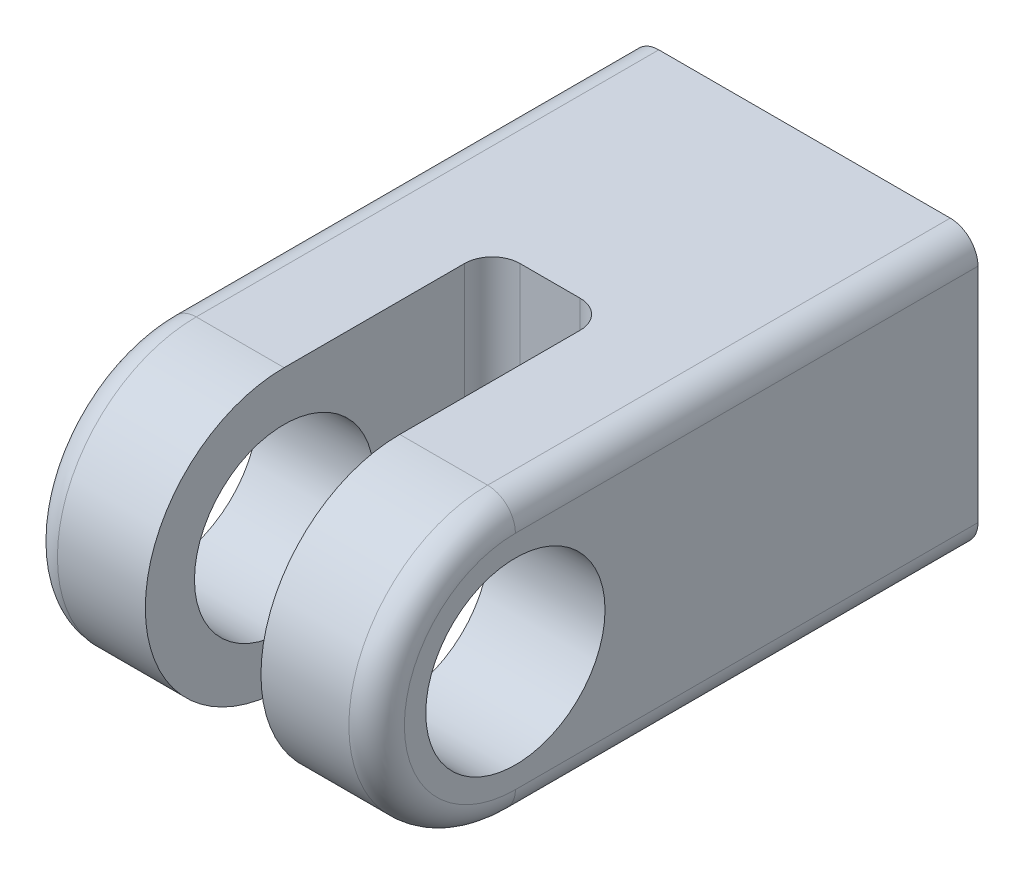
ISO-10303-21;
HEADER;
FILE_DESCRIPTION(('STEP AP214'),'2;1');
FILE_NAME('part.step','',(''),(''),'','','');
FILE_SCHEMA(('AUTOMOTIVE_DESIGN { 1 0 10303 214 1 1 1 1 }'));
ENDSEC;
DATA;
#1=APPLICATION_CONTEXT('core data for automotive mechanical design processes');
#2=APPLICATION_PROTOCOL_DEFINITION('international standard','automotive_design',2000,#1);
#3=PRODUCT_CONTEXT('',#1,'mechanical');
#4=PRODUCT('Part','Part','',(#3));
#5=PRODUCT_RELATED_PRODUCT_CATEGORY('part','',(#4));
#6=PRODUCT_DEFINITION_FORMATION('','',#4);
#7=PRODUCT_DEFINITION_CONTEXT('part definition',#1,'design');
#8=PRODUCT_DEFINITION('design','',#6,#7);
#9=PRODUCT_DEFINITION_SHAPE('','',#8);
#10=(LENGTH_UNIT() NAMED_UNIT(*) SI_UNIT(.MILLI.,.METRE.));
#11=(NAMED_UNIT(*) PLANE_ANGLE_UNIT() SI_UNIT($,.RADIAN.));
#12=(NAMED_UNIT(*) SI_UNIT($,.STERADIAN.) SOLID_ANGLE_UNIT());
#13=UNCERTAINTY_MEASURE_WITH_UNIT(LENGTH_MEASURE(1.E-05),#10,'distance_accuracy_value','');
#14=(GEOMETRIC_REPRESENTATION_CONTEXT(3) GLOBAL_UNCERTAINTY_ASSIGNED_CONTEXT((#13)) GLOBAL_UNIT_ASSIGNED_CONTEXT((#10,
#11,#12)) REPRESENTATION_CONTEXT('',''));
#15=CARTESIAN_POINT('',(0.,0.,0.));
#16=DIRECTION('',(0.,0.,1.));
#17=DIRECTION('',(1.,0.,0.));
#18=AXIS2_PLACEMENT_3D('',#15,#16,#17);
#19=CARTESIAN_POINT('',(9.525,0.,25.4));
#20=DIRECTION('',(-1.,0.,0.));
#21=DIRECTION('',(0.,0.,1.));
#22=AXIS2_PLACEMENT_3D('',#19,#20,#21);
#23=CYLINDRICAL_SURFACE('',#22,7.62);
#24=DIRECTION('',(-1.,0.,0.));
#25=VECTOR('',#24,1.);
#26=CARTESIAN_POINT('',(9.525,7.62,25.4));
#27=LINE('',#26,#25);
#28=CARTESIAN_POINT('',(-3.175,7.62,25.4));
#29=VERTEX_POINT('',#28);
#30=CARTESIAN_POINT('',(-8.00099999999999,7.62,25.4));
#31=VERTEX_POINT('',#30);
#32=EDGE_CURVE('E142',#29,#31,#27,.T.);
#33=ORIENTED_EDGE('',*,*,#32,.T.);
#34=CARTESIAN_POINT('',(-8.001,0.,25.4));
#35=DIRECTION('',(1.,0.,0.));
#36=DIRECTION('',(0.,0.,-1.));
#37=AXIS2_PLACEMENT_3D('',#34,#35,#36);
#38=CIRCLE('',#37,7.62);
#39=CARTESIAN_POINT('',(-8.00099999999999,-7.62,25.4));
#40=VERTEX_POINT('',#39);
#41=EDGE_CURVE('E214',#31,#40,#38,.T.);
#42=ORIENTED_EDGE('',*,*,#41,.T.);
#43=DIRECTION('',(-1.,0.,0.));
#44=VECTOR('',#43,1.);
#45=CARTESIAN_POINT('',(9.525,-7.62,25.4));
#46=LINE('',#45,#44);
#47=CARTESIAN_POINT('',(-3.175,-7.62,25.4));
#48=VERTEX_POINT('',#47);
#49=EDGE_CURVE('E177',#48,#40,#46,.T.);
#50=ORIENTED_EDGE('',*,*,#49,.F.);
#51=CARTESIAN_POINT('',(-3.175,0.,25.4));
#52=DIRECTION('',(-1.,0.,0.));
#53=DIRECTION('',(0.,0.,1.));
#54=AXIS2_PLACEMENT_3D('',#51,#52,#53);
#55=CIRCLE('',#54,7.62);
#56=EDGE_CURVE('E150',#48,#29,#55,.T.);
#57=ORIENTED_EDGE('',*,*,#56,.T.);
#58=EDGE_LOOP('',(#33,#42,#50,#57));
#59=FACE_BOUND('',#58,.T.);
#60=ADVANCED_FACE('F31',(#59),#23,.T.);
#61=CARTESIAN_POINT('',(9.525,7.62,0.));
#62=DIRECTION('',(0.,0.,1.));
#63=DIRECTION('',(0.,-1.,0.));
#64=AXIS2_PLACEMENT_3D('',#61,#62,#63);
#65=PLANE('',#64);
#66=CARTESIAN_POINT('',(0.,0.,0.));
#67=DIRECTION('',(0.,0.,-1.));
#68=DIRECTION('',(-1.,0.,0.));
#69=AXIS2_PLACEMENT_3D('',#66,#67,#68);
#70=CIRCLE('',#69,6.35);
#71=CARTESIAN_POINT('',(-6.35,0.,0.));
#72=VERTEX_POINT('',#71);
#73=EDGE_CURVE('E239',#72,#72,#70,.T.);
#74=ORIENTED_EDGE('',*,*,#73,.F.);
#75=EDGE_LOOP('',(#74));
#76=FACE_BOUND('',#75,.T.);
#77=DIRECTION('',(0.,1.,0.));
#78=VECTOR('',#77,1.);
#79=CARTESIAN_POINT('',(9.525,7.62,0.));
#80=LINE('',#79,#78);
#81=CARTESIAN_POINT('',(9.525,-6.096,0.));
#82=VERTEX_POINT('',#81);
#83=CARTESIAN_POINT('',(9.525,6.096,0.));
#84=VERTEX_POINT('',#83);
#85=EDGE_CURVE('E169',#82,#84,#80,.T.);
#86=ORIENTED_EDGE('',*,*,#85,.F.);
#87=CARTESIAN_POINT('',(8.001,-6.096,0.));
#88=DIRECTION('',(0.,0.,1.));
#89=DIRECTION('',(0.,-1.,0.));
#90=AXIS2_PLACEMENT_3D('',#87,#88,#89);
#91=CIRCLE('',#90,1.524);
#92=CARTESIAN_POINT('',(8.001,-7.62,0.));
#93=VERTEX_POINT('',#92);
#94=EDGE_CURVE('E200',#82,#93,#91,.F.);
#95=ORIENTED_EDGE('',*,*,#94,.T.);
#96=DIRECTION('',(-1.,0.,0.));
#97=VECTOR('',#96,1.);
#98=CARTESIAN_POINT('',(9.525,-7.62,0.));
#99=LINE('',#98,#97);
#100=CARTESIAN_POINT('',(-8.00099999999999,-7.62,0.));
#101=VERTEX_POINT('',#100);
#102=EDGE_CURVE('E172',#93,#101,#99,.T.);
#103=ORIENTED_EDGE('',*,*,#102,.T.);
#104=CARTESIAN_POINT('',(-8.001,-6.096,0.));
#105=DIRECTION('',(0.,0.,1.));
#106=DIRECTION('',(0.,-1.,0.));
#107=AXIS2_PLACEMENT_3D('',#104,#105,#106);
#108=CIRCLE('',#107,1.524);
#109=CARTESIAN_POINT('',(-9.525,-6.096,0.));
#110=VERTEX_POINT('',#109);
#111=EDGE_CURVE('E198',#101,#110,#108,.F.);
#112=ORIENTED_EDGE('',*,*,#111,.T.);
#113=DIRECTION('',(0.,1.,0.));
#114=VECTOR('',#113,1.);
#115=CARTESIAN_POINT('',(-9.525,7.62,0.));
#116=LINE('',#115,#114);
#117=CARTESIAN_POINT('',(-9.525,6.096,0.));
#118=VERTEX_POINT('',#117);
#119=EDGE_CURVE('E168',#110,#118,#116,.T.);
#120=ORIENTED_EDGE('',*,*,#119,.T.);
#121=CARTESIAN_POINT('',(-8.001,6.096,0.));
#122=DIRECTION('',(0.,0.,1.));
#123=DIRECTION('',(0.,-1.,0.));
#124=AXIS2_PLACEMENT_3D('',#121,#122,#123);
#125=CIRCLE('',#124,1.524);
#126=CARTESIAN_POINT('',(-8.00099999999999,7.62,0.));
#127=VERTEX_POINT('',#126);
#128=EDGE_CURVE('E194',#118,#127,#125,.F.);
#129=ORIENTED_EDGE('',*,*,#128,.T.);
#130=DIRECTION('',(-1.,0.,0.));
#131=VECTOR('',#130,1.);
#132=CARTESIAN_POINT('',(9.525,7.62,0.));
#133=LINE('',#132,#131);
#134=CARTESIAN_POINT('',(8.001,7.62,0.));
#135=VERTEX_POINT('',#134);
#136=EDGE_CURVE('E141',#135,#127,#133,.T.);
#137=ORIENTED_EDGE('',*,*,#136,.F.);
#138=CARTESIAN_POINT('',(8.001,6.096,0.));
#139=DIRECTION('',(0.,0.,1.));
#140=DIRECTION('',(0.,-1.,0.));
#141=AXIS2_PLACEMENT_3D('',#138,#139,#140);
#142=CIRCLE('',#141,1.524);
#143=EDGE_CURVE('E196',#135,#84,#142,.F.);
#144=ORIENTED_EDGE('',*,*,#143,.T.);
#145=EDGE_LOOP('',(#86,#95,#103,#112,#120,#129,#137,#144));
#146=FACE_BOUND('',#145,.T.);
#147=ADVANCED_FACE('F262',(#76,#146),#65,.F.);
#148=CARTESIAN_POINT('',(9.525,7.62,0.));
#149=DIRECTION('',(0.,-1.,0.));
#150=DIRECTION('',(0.,0.,-1.));
#151=AXIS2_PLACEMENT_3D('',#148,#149,#150);
#152=PLANE('',#151);
#153=CARTESIAN_POINT('',(8.001,7.62,25.4));
#154=VERTEX_POINT('',#153);
#155=CARTESIAN_POINT('',(3.17500000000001,7.62,25.4));
#156=VERTEX_POINT('',#155);
#157=EDGE_CURVE('E132',#154,#156,#27,.T.);
#158=ORIENTED_EDGE('',*,*,#157,.F.);
#159=DIRECTION('',(0.,0.,1.));
#160=VECTOR('',#159,1.);
#161=CARTESIAN_POINT('',(8.001,7.62,0.));
#162=LINE('',#161,#160);
#163=EDGE_CURVE('E218',#154,#135,#162,.F.);
#164=ORIENTED_EDGE('',*,*,#163,.T.);
#165=ORIENTED_EDGE('',*,*,#136,.T.);
#166=DIRECTION('',(0.,0.,1.));
#167=VECTOR('',#166,1.);
#168=CARTESIAN_POINT('',(-8.001,7.62,0.));
#169=LINE('',#168,#167);
#170=EDGE_CURVE('E216',#127,#31,#169,.T.);
#171=ORIENTED_EDGE('',*,*,#170,.T.);
#172=ORIENTED_EDGE('',*,*,#32,.F.);
#173=DIRECTION('',(0.,0.,1.));
#174=VECTOR('',#173,1.);
#175=CARTESIAN_POINT('',(-3.175,7.62,13.97));
#176=LINE('',#175,#174);
#177=CARTESIAN_POINT('',(-3.175,7.62,15.494));
#178=VERTEX_POINT('',#177);
#179=EDGE_CURVE('E155',#178,#29,#176,.T.);
#180=ORIENTED_EDGE('',*,*,#179,.F.);
#181=CARTESIAN_POINT('',(-1.651,7.62,15.494));
#182=DIRECTION('',(0.,-1.,0.));
#183=DIRECTION('',(0.,0.,-1.));
#184=AXIS2_PLACEMENT_3D('',#181,#182,#183);
#185=CIRCLE('',#184,1.524);
#186=CARTESIAN_POINT('',(-1.651,7.62,13.97));
#187=VERTEX_POINT('',#186);
#188=EDGE_CURVE('E53',#178,#187,#185,.T.);
#189=ORIENTED_EDGE('',*,*,#188,.T.);
#190=DIRECTION('',(-1.,0.,0.));
#191=VECTOR('',#190,1.);
#192=CARTESIAN_POINT('',(-3.175,7.62,13.97));
#193=LINE('',#192,#191);
#194=CARTESIAN_POINT('',(1.651,7.62,13.97));
#195=VERTEX_POINT('',#194);
#196=EDGE_CURVE('E154',#195,#187,#193,.T.);
#197=ORIENTED_EDGE('',*,*,#196,.F.);
#198=CARTESIAN_POINT('',(1.651,7.62,15.494));
#199=DIRECTION('',(0.,-1.,0.));
#200=DIRECTION('',(0.,0.,-1.));
#201=AXIS2_PLACEMENT_3D('',#198,#199,#200);
#202=CIRCLE('',#201,1.524);
#203=CARTESIAN_POINT('',(3.175,7.62,15.494));
#204=VERTEX_POINT('',#203);
#205=EDGE_CURVE('E40',#195,#204,#202,.T.);
#206=ORIENTED_EDGE('',*,*,#205,.T.);
#207=DIRECTION('',(0.,0.,-1.));
#208=VECTOR('',#207,1.);
#209=CARTESIAN_POINT('',(3.175,7.62,13.97));
#210=LINE('',#209,#208);
#211=EDGE_CURVE('E146',#156,#204,#210,.T.);
#212=ORIENTED_EDGE('',*,*,#211,.F.);
#213=EDGE_LOOP('',(#158,#164,#165,#171,#172,#180,#189,#197,#206,#212));
#214=FACE_BOUND('',#213,.T.);
#215=ADVANCED_FACE('F153',(#214),#152,.F.);
#216=CARTESIAN_POINT('',(8.001,-7.62,25.4));
#217=VERTEX_POINT('',#216);
#218=CARTESIAN_POINT('',(3.17500000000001,-7.62,25.4));
#219=VERTEX_POINT('',#218);
#220=EDGE_CURVE('E178',#217,#219,#46,.T.);
#221=ORIENTED_EDGE('',*,*,#220,.F.);
#222=CARTESIAN_POINT('',(8.001,0.,25.4));
#223=DIRECTION('',(1.,0.,0.));
#224=DIRECTION('',(0.,0.,-1.));
#225=AXIS2_PLACEMENT_3D('',#222,#223,#224);
#226=CIRCLE('',#225,7.62);
#227=EDGE_CURVE('E139',#217,#154,#226,.F.);
#228=ORIENTED_EDGE('',*,*,#227,.T.);
#229=ORIENTED_EDGE('',*,*,#157,.T.);
#230=CARTESIAN_POINT('',(3.17500000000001,0.,25.4));
#231=DIRECTION('',(1.,0.,0.));
#232=DIRECTION('',(0.,0.,-1.));
#233=AXIS2_PLACEMENT_3D('',#230,#231,#232);
#234=CIRCLE('',#233,7.62);
#235=EDGE_CURVE('E136',#156,#219,#234,.T.);
#236=ORIENTED_EDGE('',*,*,#235,.T.);
#237=EDGE_LOOP('',(#221,#228,#229,#236));
#238=FACE_BOUND('',#237,.T.);
#239=ADVANCED_FACE('F135',(#238),#23,.T.);
#240=CARTESIAN_POINT('',(9.525,-7.62,0.));
#241=DIRECTION('',(0.,1.,0.));
#242=DIRECTION('',(0.,0.,1.));
#243=AXIS2_PLACEMENT_3D('',#240,#241,#242);
#244=PLANE('',#243);
#245=ORIENTED_EDGE('',*,*,#102,.F.);
#246=DIRECTION('',(0.,0.,-1.));
#247=VECTOR('',#246,1.);
#248=CARTESIAN_POINT('',(8.001,-7.62,25.4));
#249=LINE('',#248,#247);
#250=EDGE_CURVE('E205',#93,#217,#249,.F.);
#251=ORIENTED_EDGE('',*,*,#250,.T.);
#252=ORIENTED_EDGE('',*,*,#220,.T.);
#253=DIRECTION('',(0.,0.,-1.));
#254=VECTOR('',#253,1.);
#255=CARTESIAN_POINT('',(3.175,-7.62,0.));
#256=LINE('',#255,#254);
#257=CARTESIAN_POINT('',(3.175,-7.62,15.494));
#258=VERTEX_POINT('',#257);
#259=EDGE_CURVE('E149',#219,#258,#256,.T.);
#260=ORIENTED_EDGE('',*,*,#259,.T.);
#261=CARTESIAN_POINT('',(1.651,-7.62,15.494));
#262=DIRECTION('',(0.,1.,0.));
#263=DIRECTION('',(0.,0.,1.));
#264=AXIS2_PLACEMENT_3D('',#261,#262,#263);
#265=CIRCLE('',#264,1.524);
#266=CARTESIAN_POINT('',(1.651,-7.62,13.97));
#267=VERTEX_POINT('',#266);
#268=EDGE_CURVE('E11',#258,#267,#265,.T.);
#269=ORIENTED_EDGE('',*,*,#268,.T.);
#270=DIRECTION('',(-1.,0.,0.));
#271=VECTOR('',#270,1.);
#272=CARTESIAN_POINT('',(-3.175,-7.62,13.97));
#273=LINE('',#272,#271);
#274=CARTESIAN_POINT('',(-1.651,-7.62,13.97));
#275=VERTEX_POINT('',#274);
#276=EDGE_CURVE('E151',#267,#275,#273,.T.);
#277=ORIENTED_EDGE('',*,*,#276,.T.);
#278=CARTESIAN_POINT('',(-1.651,-7.62,15.494));
#279=DIRECTION('',(0.,1.,0.));
#280=DIRECTION('',(0.,0.,1.));
#281=AXIS2_PLACEMENT_3D('',#278,#279,#280);
#282=CIRCLE('',#281,1.524);
#283=CARTESIAN_POINT('',(-3.175,-7.62,15.494));
#284=VERTEX_POINT('',#283);
#285=EDGE_CURVE('E231',#275,#284,#282,.T.);
#286=ORIENTED_EDGE('',*,*,#285,.T.);
#287=DIRECTION('',(0.,0.,1.));
#288=VECTOR('',#287,1.);
#289=CARTESIAN_POINT('',(-3.175,-7.62,13.97));
#290=LINE('',#289,#288);
#291=EDGE_CURVE('E157',#284,#48,#290,.T.);
#292=ORIENTED_EDGE('',*,*,#291,.T.);
#293=ORIENTED_EDGE('',*,*,#49,.T.);
#294=DIRECTION('',(0.,0.,-1.));
#295=VECTOR('',#294,1.);
#296=CARTESIAN_POINT('',(-8.001,-7.62,0.));
#297=LINE('',#296,#295);
#298=EDGE_CURVE('E202',#40,#101,#297,.T.);
#299=ORIENTED_EDGE('',*,*,#298,.T.);
#300=EDGE_LOOP('',(#245,#251,#252,#260,#269,#277,#286,#292,#293,#299));
#301=FACE_BOUND('',#300,.T.);
#302=ADVANCED_FACE('F268',(#301),#244,.F.);
#303=CARTESIAN_POINT('',(9.525,0.,25.4));
#304=DIRECTION('',(1.,0.,0.));
#305=DIRECTION('',(0.,0.,-1.));
#306=AXIS2_PLACEMENT_3D('',#303,#304,#305);
#307=PLANE('',#306);
#308=CARTESIAN_POINT('',(9.525,0.,25.4));
#309=DIRECTION('',(1.,0.,0.));
#310=DIRECTION('',(0.,0.,-1.));
#311=AXIS2_PLACEMENT_3D('',#308,#309,#310);
#312=CIRCLE('',#311,4.92125);
#313=CARTESIAN_POINT('',(9.525,0.,20.47875));
#314=VERTEX_POINT('',#313);
#315=EDGE_CURVE('E422',#314,#314,#312,.T.);
#316=ORIENTED_EDGE('',*,*,#315,.F.);
#317=EDGE_LOOP('',(#316));
#318=FACE_BOUND('',#317,.T.);
#319=CARTESIAN_POINT('',(9.525,0.,25.4));
#320=DIRECTION('',(1.,0.,0.));
#321=DIRECTION('',(0.,0.,-1.));
#322=AXIS2_PLACEMENT_3D('',#319,#320,#321);
#323=CIRCLE('',#322,6.096);
#324=CARTESIAN_POINT('',(9.525,6.096,25.4));
#325=VERTEX_POINT('',#324);
#326=CARTESIAN_POINT('',(9.525,-6.096,25.4));
#327=VERTEX_POINT('',#326);
#328=EDGE_CURVE('E189',#325,#327,#323,.T.);
#329=ORIENTED_EDGE('',*,*,#328,.T.);
#330=DIRECTION('',(0.,0.,-1.));
#331=VECTOR('',#330,1.);
#332=CARTESIAN_POINT('',(9.525,-6.096,0.));
#333=LINE('',#332,#331);
#334=EDGE_CURVE('E191',#327,#82,#333,.T.);
#335=ORIENTED_EDGE('',*,*,#334,.T.);
#336=ORIENTED_EDGE('',*,*,#85,.T.);
#337=DIRECTION('',(0.,0.,1.));
#338=VECTOR('',#337,1.);
#339=CARTESIAN_POINT('',(9.525,6.096,25.4));
#340=LINE('',#339,#338);
#341=EDGE_CURVE('E183',#84,#325,#340,.T.);
#342=ORIENTED_EDGE('',*,*,#341,.T.);
#343=EDGE_LOOP('',(#329,#335,#336,#342));
#344=FACE_BOUND('',#343,.T.);
#345=ADVANCED_FACE('F283',(#318,#344),#307,.T.);
#346=CARTESIAN_POINT('',(-9.525,0.,25.4));
#347=DIRECTION('',(1.,0.,0.));
#348=DIRECTION('',(0.,0.,-1.));
#349=AXIS2_PLACEMENT_3D('',#346,#347,#348);
#350=PLANE('',#349);
#351=CARTESIAN_POINT('',(-9.525,0.,25.4));
#352=DIRECTION('',(1.,0.,0.));
#353=DIRECTION('',(0.,0.,-1.));
#354=AXIS2_PLACEMENT_3D('',#351,#352,#353);
#355=CIRCLE('',#354,4.92125);
#356=CARTESIAN_POINT('',(-9.525,0.,20.47875));
#357=VERTEX_POINT('',#356);
#358=EDGE_CURVE('E187',#357,#357,#355,.T.);
#359=ORIENTED_EDGE('',*,*,#358,.T.);
#360=EDGE_LOOP('',(#359));
#361=FACE_BOUND('',#360,.T.);
#362=ORIENTED_EDGE('',*,*,#119,.F.);
#363=DIRECTION('',(0.,0.,-1.));
#364=VECTOR('',#363,1.);
#365=CARTESIAN_POINT('',(-9.525,-6.096,25.4));
#366=LINE('',#365,#364);
#367=CARTESIAN_POINT('',(-9.525,-6.096,25.4));
#368=VERTEX_POINT('',#367);
#369=EDGE_CURVE('E212',#110,#368,#366,.F.);
#370=ORIENTED_EDGE('',*,*,#369,.T.);
#371=CARTESIAN_POINT('',(-9.525,0.,25.4));
#372=DIRECTION('',(1.,0.,0.));
#373=DIRECTION('',(0.,0.,-1.));
#374=AXIS2_PLACEMENT_3D('',#371,#372,#373);
#375=CIRCLE('',#374,6.096);
#376=CARTESIAN_POINT('',(-9.525,6.096,25.4));
#377=VERTEX_POINT('',#376);
#378=EDGE_CURVE('E210',#368,#377,#375,.F.);
#379=ORIENTED_EDGE('',*,*,#378,.T.);
#380=DIRECTION('',(0.,0.,1.));
#381=VECTOR('',#380,1.);
#382=CARTESIAN_POINT('',(-9.525,6.096,25.4));
#383=LINE('',#382,#381);
#384=EDGE_CURVE('E208',#377,#118,#383,.F.);
#385=ORIENTED_EDGE('',*,*,#384,.T.);
#386=EDGE_LOOP('',(#362,#370,#379,#385));
#387=FACE_BOUND('',#386,.T.);
#388=ADVANCED_FACE('F259',(#361,#387),#350,.F.);
#389=CARTESIAN_POINT('',(-3.175,-7.62,13.97));
#390=DIRECTION('',(-1.,0.,0.));
#391=DIRECTION('',(0.,0.,1.));
#392=AXIS2_PLACEMENT_3D('',#389,#390,#391);
#393=PLANE('',#392);
#394=CARTESIAN_POINT('',(-3.175,0.,25.4));
#395=DIRECTION('',(-1.,0.,0.));
#396=DIRECTION('',(0.,0.,1.));
#397=AXIS2_PLACEMENT_3D('',#394,#395,#396);
#398=CIRCLE('',#397,4.92125);
#399=CARTESIAN_POINT('',(-3.175,0.,20.47875));
#400=VERTEX_POINT('',#399);
#401=EDGE_CURVE('E159',#400,#400,#398,.T.);
#402=ORIENTED_EDGE('',*,*,#401,.T.);
#403=EDGE_LOOP('',(#402));
#404=FACE_BOUND('',#403,.T.);
#405=ORIENTED_EDGE('',*,*,#291,.F.);
#406=DIRECTION('',(0.,1.,0.));
#407=VECTOR('',#406,1.);
#408=CARTESIAN_POINT('',(-3.175,7.62,15.494));
#409=LINE('',#408,#407);
#410=EDGE_CURVE('E220',#284,#178,#409,.T.);
#411=ORIENTED_EDGE('',*,*,#410,.T.);
#412=ORIENTED_EDGE('',*,*,#179,.T.);
#413=ORIENTED_EDGE('',*,*,#56,.F.);
#414=EDGE_LOOP('',(#405,#411,#412,#413));
#415=FACE_BOUND('',#414,.T.);
#416=ADVANCED_FACE('F381',(#404,#415),#393,.F.);
#417=CARTESIAN_POINT('',(3.175,-7.62,13.97));
#418=DIRECTION('',(1.,0.,0.));
#419=DIRECTION('',(0.,0.,-1.));
#420=AXIS2_PLACEMENT_3D('',#417,#418,#419);
#421=PLANE('',#420);
#422=CARTESIAN_POINT('',(3.175,0.,25.4));
#423=DIRECTION('',(1.,0.,0.));
#424=DIRECTION('',(0.,0.,-1.));
#425=AXIS2_PLACEMENT_3D('',#422,#423,#424);
#426=CIRCLE('',#425,4.92125);
#427=CARTESIAN_POINT('',(3.175,0.,20.47875));
#428=VERTEX_POINT('',#427);
#429=EDGE_CURVE('E184',#428,#428,#426,.T.);
#430=ORIENTED_EDGE('',*,*,#429,.T.);
#431=EDGE_LOOP('',(#430));
#432=FACE_BOUND('',#431,.T.);
#433=ORIENTED_EDGE('',*,*,#211,.T.);
#434=DIRECTION('',(0.,1.,0.));
#435=VECTOR('',#434,1.);
#436=CARTESIAN_POINT('',(3.175,-7.62,15.494));
#437=LINE('',#436,#435);
#438=EDGE_CURVE('E228',#204,#258,#437,.F.);
#439=ORIENTED_EDGE('',*,*,#438,.T.);
#440=ORIENTED_EDGE('',*,*,#259,.F.);
#441=ORIENTED_EDGE('',*,*,#235,.F.);
#442=EDGE_LOOP('',(#433,#439,#440,#441));
#443=FACE_BOUND('',#442,.T.);
#444=ADVANCED_FACE('F145',(#432,#443),#421,.F.);
#445=CARTESIAN_POINT('',(-3.175,-7.62,13.97));
#446=DIRECTION('',(0.,0.,-1.));
#447=DIRECTION('',(-1.,0.,0.));
#448=AXIS2_PLACEMENT_3D('',#445,#446,#447);
#449=PLANE('',#448);
#450=ORIENTED_EDGE('',*,*,#196,.T.);
#451=DIRECTION('',(0.,1.,0.));
#452=VECTOR('',#451,1.);
#453=CARTESIAN_POINT('',(-1.651,-7.62,13.97));
#454=LINE('',#453,#452);
#455=EDGE_CURVE('E226',#187,#275,#454,.F.);
#456=ORIENTED_EDGE('',*,*,#455,.T.);
#457=ORIENTED_EDGE('',*,*,#276,.F.);
#458=DIRECTION('',(0.,1.,0.));
#459=VECTOR('',#458,1.);
#460=CARTESIAN_POINT('',(1.651,7.62,13.97));
#461=LINE('',#460,#459);
#462=EDGE_CURVE('E223',#267,#195,#461,.T.);
#463=ORIENTED_EDGE('',*,*,#462,.T.);
#464=EDGE_LOOP('',(#450,#456,#457,#463));
#465=FACE_BOUND('',#464,.T.);
#466=ADVANCED_FACE('F364',(#465),#449,.F.);
#467=CARTESIAN_POINT('',(-9.525,0.,25.4));
#468=DIRECTION('',(1.,0.,0.));
#469=DIRECTION('',(0.,0.,-1.));
#470=AXIS2_PLACEMENT_3D('',#467,#468,#469);
#471=CYLINDRICAL_SURFACE('',#470,4.92125);
#472=CARTESIAN_POINT('',(9.525,0.,20.47875));
#473=CARTESIAN_POINT('',(9.45885416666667,0.,20.47875));
#474=CARTESIAN_POINT('',(9.39270833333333,0.,20.47875));
#475=CARTESIAN_POINT('',(9.26041666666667,0.,20.47875));
#476=CARTESIAN_POINT('',(9.19427083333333,0.,20.47875));
#477=CARTESIAN_POINT('',(9.06197916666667,0.,20.47875));
#478=CARTESIAN_POINT('',(8.99583333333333,0.,20.47875));
#479=CARTESIAN_POINT('',(8.86354166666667,0.,20.47875));
#480=CARTESIAN_POINT('',(8.79739583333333,0.,20.47875));
#481=CARTESIAN_POINT('',(8.66510416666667,0.,20.47875));
#482=CARTESIAN_POINT('',(8.59895833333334,0.,20.47875));
#483=CARTESIAN_POINT('',(8.46666666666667,0.,20.47875));
#484=CARTESIAN_POINT('',(8.40052083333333,0.,20.47875));
#485=CARTESIAN_POINT('',(8.26822916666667,0.,20.47875));
#486=CARTESIAN_POINT('',(8.20208333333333,0.,20.47875));
#487=CARTESIAN_POINT('',(8.06979166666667,0.,20.47875));
#488=CARTESIAN_POINT('',(8.00364583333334,0.,20.47875));
#489=CARTESIAN_POINT('',(7.87135416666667,0.,20.47875));
#490=CARTESIAN_POINT('',(7.80520833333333,0.,20.47875));
#491=CARTESIAN_POINT('',(7.67291666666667,0.,20.47875));
#492=CARTESIAN_POINT('',(7.60677083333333,0.,20.47875));
#493=CARTESIAN_POINT('',(7.47447916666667,0.,20.47875));
#494=CARTESIAN_POINT('',(7.40833333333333,0.,20.47875));
#495=CARTESIAN_POINT('',(7.27604166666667,0.,20.47875));
#496=CARTESIAN_POINT('',(7.20989583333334,0.,20.47875));
#497=CARTESIAN_POINT('',(7.07760416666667,0.,20.47875));
#498=CARTESIAN_POINT('',(7.01145833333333,0.,20.47875));
#499=CARTESIAN_POINT('',(6.87916666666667,0.,20.47875));
#500=CARTESIAN_POINT('',(6.81302083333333,0.,20.47875));
#501=CARTESIAN_POINT('',(6.68072916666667,0.,20.47875));
#502=CARTESIAN_POINT('',(6.61458333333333,0.,20.47875));
#503=CARTESIAN_POINT('',(6.48229166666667,0.,20.47875));
#504=CARTESIAN_POINT('',(6.41614583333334,0.,20.47875));
#505=CARTESIAN_POINT('',(6.28385416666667,0.,20.47875));
#506=CARTESIAN_POINT('',(6.21770833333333,0.,20.47875));
#507=CARTESIAN_POINT('',(6.08541666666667,0.,20.47875));
#508=CARTESIAN_POINT('',(6.01927083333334,0.,20.47875));
#509=CARTESIAN_POINT('',(5.88697916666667,0.,20.47875));
#510=CARTESIAN_POINT('',(5.82083333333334,0.,20.47875));
#511=CARTESIAN_POINT('',(5.68854166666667,0.,20.47875));
#512=CARTESIAN_POINT('',(5.62239583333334,0.,20.47875));
#513=CARTESIAN_POINT('',(5.49010416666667,0.,20.47875));
#514=CARTESIAN_POINT('',(5.42395833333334,0.,20.47875));
#515=CARTESIAN_POINT('',(5.29166666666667,0.,20.47875));
#516=CARTESIAN_POINT('',(5.22552083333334,0.,20.47875));
#517=CARTESIAN_POINT('',(5.09322916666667,0.,20.47875));
#518=CARTESIAN_POINT('',(5.02708333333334,0.,20.47875));
#519=CARTESIAN_POINT('',(4.89479166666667,0.,20.47875));
#520=CARTESIAN_POINT('',(4.82864583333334,0.,20.47875));
#521=CARTESIAN_POINT('',(4.69635416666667,0.,20.47875));
#522=CARTESIAN_POINT('',(4.63020833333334,0.,20.47875));
#523=CARTESIAN_POINT('',(4.49791666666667,0.,20.47875));
#524=CARTESIAN_POINT('',(4.43177083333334,0.,20.47875));
#525=CARTESIAN_POINT('',(4.29947916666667,0.,20.47875));
#526=CARTESIAN_POINT('',(4.23333333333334,0.,20.47875));
#527=CARTESIAN_POINT('',(4.10104166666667,0.,20.47875));
#528=CARTESIAN_POINT('',(4.03489583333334,0.,20.47875));
#529=CARTESIAN_POINT('',(3.90260416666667,0.,20.47875));
#530=CARTESIAN_POINT('',(3.83645833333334,0.,20.47875));
#531=CARTESIAN_POINT('',(3.70416666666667,0.,20.47875));
#532=CARTESIAN_POINT('',(3.63802083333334,0.,20.47875));
#533=CARTESIAN_POINT('',(3.50572916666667,0.,20.47875));
#534=CARTESIAN_POINT('',(3.43958333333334,0.,20.47875));
#535=CARTESIAN_POINT('',(3.30729166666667,0.,20.47875));
#536=CARTESIAN_POINT('',(3.24114583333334,0.,20.47875));
#537=CARTESIAN_POINT('',(3.175,0.,20.47875));
#538=B_SPLINE_CURVE_WITH_KNOTS('',3,(#472,#473,#474,#475,#476,#477,#478,#479,#480,#481,#482,
#483,#484,#485,#486,#487,#488,#489,#490,#491,#492,#493,#494,#495,#496,#497,#498,#499,#500,#501,
#502,#503,#504,#505,#506,#507,#508,#509,#510,#511,#512,#513,#514,#515,#516,#517,#518,#519,#520,
#521,#522,#523,#524,#525,#526,#527,#528,#529,#530,#531,#532,#533,#534,#535,#536,#537),
.UNSPECIFIED.,.F.,.F.,(4,2,2,2,2,2,2,2,2,2,2,2,2,2,2,2,2,2,2,2,2,2,2,2,2,2,2,2,2,2,2,2,4),(0.,
0.198437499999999,0.396875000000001,0.5953125,0.793749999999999,0.992187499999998,1.190625,
1.3890625,1.5875,1.7859375,1.984375,2.1828125,2.38125,2.5796875,2.778125,2.9765625,3.175,
3.3734375,3.571875,3.7703125,3.96875,4.1671875,4.365625,4.5640625,4.7625,4.9609375,5.159375,
5.3578125,5.55625,5.7546875,5.953125,6.1515625,6.35),.UNSPECIFIED.);
#539=EDGE_CURVE('BSEAM355',#314,#428,#538,.T.);
#540=ORIENTED_EDGE('',*,*,#315,.T.);
#541=ORIENTED_EDGE('',*,*,#429,.F.);
#542=ORIENTED_EDGE('',*,*,#539,.T.);
#543=ORIENTED_EDGE('',*,*,#539,.F.);
#544=EDGE_LOOP('',(#540,#542,#541,#543));
#545=FACE_BOUND('',#544,.T.);
#546=ADVANCED_FACE('F355',(#545),#471,.F.);
#547=CARTESIAN_POINT('',(-9.525,0.,20.47875));
#548=CARTESIAN_POINT('',(-9.45885416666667,0.,20.47875));
#549=CARTESIAN_POINT('',(-9.39270833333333,0.,20.47875));
#550=CARTESIAN_POINT('',(-9.26041666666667,0.,20.47875));
#551=CARTESIAN_POINT('',(-9.19427083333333,0.,20.47875));
#552=CARTESIAN_POINT('',(-9.06197916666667,0.,20.47875));
#553=CARTESIAN_POINT('',(-8.99583333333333,0.,20.47875));
#554=CARTESIAN_POINT('',(-8.86354166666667,0.,20.47875));
#555=CARTESIAN_POINT('',(-8.79739583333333,0.,20.47875));
#556=CARTESIAN_POINT('',(-8.66510416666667,0.,20.47875));
#557=CARTESIAN_POINT('',(-8.59895833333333,0.,20.47875));
#558=CARTESIAN_POINT('',(-8.46666666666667,0.,20.47875));
#559=CARTESIAN_POINT('',(-8.40052083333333,0.,20.47875));
#560=CARTESIAN_POINT('',(-8.26822916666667,0.,20.47875));
#561=CARTESIAN_POINT('',(-8.20208333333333,0.,20.47875));
#562=CARTESIAN_POINT('',(-8.06979166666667,0.,20.47875));
#563=CARTESIAN_POINT('',(-8.00364583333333,0.,20.47875));
#564=CARTESIAN_POINT('',(-7.87135416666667,0.,20.47875));
#565=CARTESIAN_POINT('',(-7.80520833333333,0.,20.47875));
#566=CARTESIAN_POINT('',(-7.67291666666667,0.,20.47875));
#567=CARTESIAN_POINT('',(-7.60677083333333,0.,20.47875));
#568=CARTESIAN_POINT('',(-7.47447916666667,0.,20.47875));
#569=CARTESIAN_POINT('',(-7.40833333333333,0.,20.47875));
#570=CARTESIAN_POINT('',(-7.27604166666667,0.,20.47875));
#571=CARTESIAN_POINT('',(-7.20989583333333,0.,20.47875));
#572=CARTESIAN_POINT('',(-7.07760416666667,0.,20.47875));
#573=CARTESIAN_POINT('',(-7.01145833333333,0.,20.47875));
#574=CARTESIAN_POINT('',(-6.87916666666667,0.,20.47875));
#575=CARTESIAN_POINT('',(-6.81302083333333,0.,20.47875));
#576=CARTESIAN_POINT('',(-6.68072916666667,0.,20.47875));
#577=CARTESIAN_POINT('',(-6.61458333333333,0.,20.47875));
#578=CARTESIAN_POINT('',(-6.48229166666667,0.,20.47875));
#579=CARTESIAN_POINT('',(-6.41614583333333,0.,20.47875));
#580=CARTESIAN_POINT('',(-6.28385416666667,0.,20.47875));
#581=CARTESIAN_POINT('',(-6.21770833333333,0.,20.47875));
#582=CARTESIAN_POINT('',(-6.08541666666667,0.,20.47875));
#583=CARTESIAN_POINT('',(-6.01927083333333,0.,20.47875));
#584=CARTESIAN_POINT('',(-5.88697916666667,0.,20.47875));
#585=CARTESIAN_POINT('',(-5.82083333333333,0.,20.47875));
#586=CARTESIAN_POINT('',(-5.68854166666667,0.,20.47875));
#587=CARTESIAN_POINT('',(-5.62239583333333,0.,20.47875));
#588=CARTESIAN_POINT('',(-5.49010416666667,0.,20.47875));
#589=CARTESIAN_POINT('',(-5.42395833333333,0.,20.47875));
#590=CARTESIAN_POINT('',(-5.29166666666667,0.,20.47875));
#591=CARTESIAN_POINT('',(-5.22552083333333,0.,20.47875));
#592=CARTESIAN_POINT('',(-5.09322916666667,0.,20.47875));
#593=CARTESIAN_POINT('',(-5.02708333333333,0.,20.47875));
#594=CARTESIAN_POINT('',(-4.89479166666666,0.,20.47875));
#595=CARTESIAN_POINT('',(-4.82864583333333,0.,20.47875));
#596=CARTESIAN_POINT('',(-4.69635416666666,0.,20.47875));
#597=CARTESIAN_POINT('',(-4.63020833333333,0.,20.47875));
#598=CARTESIAN_POINT('',(-4.49791666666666,0.,20.47875));
#599=CARTESIAN_POINT('',(-4.43177083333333,0.,20.47875));
#600=CARTESIAN_POINT('',(-4.29947916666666,0.,20.47875));
#601=CARTESIAN_POINT('',(-4.23333333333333,0.,20.47875));
#602=CARTESIAN_POINT('',(-4.10104166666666,0.,20.47875));
#603=CARTESIAN_POINT('',(-4.03489583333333,0.,20.47875));
#604=CARTESIAN_POINT('',(-3.90260416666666,0.,20.47875));
#605=CARTESIAN_POINT('',(-3.83645833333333,0.,20.47875));
#606=CARTESIAN_POINT('',(-3.70416666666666,0.,20.47875));
#607=CARTESIAN_POINT('',(-3.63802083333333,0.,20.47875));
#608=CARTESIAN_POINT('',(-3.50572916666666,0.,20.47875));
#609=CARTESIAN_POINT('',(-3.43958333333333,0.,20.47875));
#610=CARTESIAN_POINT('',(-3.30729166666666,0.,20.47875));
#611=CARTESIAN_POINT('',(-3.24114583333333,0.,20.47875));
#612=CARTESIAN_POINT('',(-3.175,0.,20.47875));
#613=B_SPLINE_CURVE_WITH_KNOTS('',3,(#547,#548,#549,#550,#551,#552,#553,#554,#555,#556,#557,
#558,#559,#560,#561,#562,#563,#564,#565,#566,#567,#568,#569,#570,#571,#572,#573,#574,#575,#576,
#577,#578,#579,#580,#581,#582,#583,#584,#585,#586,#587,#588,#589,#590,#591,#592,#593,#594,#595,
#596,#597,#598,#599,#600,#601,#602,#603,#604,#605,#606,#607,#608,#609,#610,#611,#612),
.UNSPECIFIED.,.F.,.F.,(4,2,2,2,2,2,2,2,2,2,2,2,2,2,2,2,2,2,2,2,2,2,2,2,2,2,2,2,2,2,2,2,4),(0.,
0.198437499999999,0.396875,0.5953125,0.793749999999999,0.9921875,1.190625,1.3890625,1.5875,
1.7859375,1.984375,2.1828125,2.38125,2.5796875,2.778125,2.9765625,3.175,3.3734375,3.571875,
3.7703125,3.96875,4.1671875,4.365625,4.5640625,4.7625,4.9609375,5.159375,5.3578125,5.55625,
5.7546875,5.953125,6.1515625,6.35),.UNSPECIFIED.);
#614=EDGE_CURVE('BSEAM345',#357,#400,#613,.T.);
#615=ORIENTED_EDGE('',*,*,#358,.F.);
#616=ORIENTED_EDGE('',*,*,#401,.F.);
#617=ORIENTED_EDGE('',*,*,#614,.T.);
#618=ORIENTED_EDGE('',*,*,#614,.F.);
#619=EDGE_LOOP('',(#615,#617,#616,#618));
#620=FACE_BOUND('',#619,.T.);
#621=ADVANCED_FACE('F345',(#620),#471,.F.);
#622=CARTESIAN_POINT('',(0.,0.,9.8425));
#623=DIRECTION('',(0.,0.,-1.));
#624=DIRECTION('',(-1.,0.,0.));
#625=AXIS2_PLACEMENT_3D('',#622,#623,#624);
#626=CYLINDRICAL_SURFACE('',#625,6.35);
#627=CARTESIAN_POINT('',(0.,0.,9.8425));
#628=DIRECTION('',(0.,0.,-1.));
#629=DIRECTION('',(-1.,0.,0.));
#630=AXIS2_PLACEMENT_3D('',#627,#628,#629);
#631=CIRCLE('',#630,6.35);
#632=CARTESIAN_POINT('',(-6.35,0.,9.8425));
#633=VERTEX_POINT('',#632);
#634=EDGE_CURVE('E423',#633,#633,#631,.T.);
#635=ORIENTED_EDGE('',*,*,#634,.F.);
#636=EDGE_LOOP('',(#635));
#637=FACE_BOUND('',#636,.T.);
#638=ORIENTED_EDGE('',*,*,#73,.T.);
#639=EDGE_LOOP('',(#638));
#640=FACE_BOUND('',#639,.T.);
#641=ADVANCED_FACE('F334',(#637,#640),#626,.F.);
#642=CARTESIAN_POINT('',(0.,0.,9.8425));
#643=DIRECTION('',(0.,0.,-1.));
#644=DIRECTION('',(-1.,0.,0.));
#645=AXIS2_PLACEMENT_3D('',#642,#643,#644);
#646=PLANE('',#645);
#647=ORIENTED_EDGE('',*,*,#634,.T.);
#648=EDGE_LOOP('',(#647));
#649=FACE_BOUND('',#648,.T.);
#650=ADVANCED_FACE('F297',(#649),#646,.T.);
#651=CARTESIAN_POINT('',(8.001,6.096,25.4));
#652=DIRECTION('',(0.,0.,-1.));
#653=DIRECTION('',(0.,1.,0.));
#654=AXIS2_PLACEMENT_3D('',#651,#652,#653);
#655=CYLINDRICAL_SURFACE('',#654,1.524);
#656=ORIENTED_EDGE('',*,*,#143,.F.);
#657=ORIENTED_EDGE('',*,*,#163,.F.);
#658=CARTESIAN_POINT('',(8.001,6.096,25.4));
#659=DIRECTION('',(0.,0.,1.));
#660=DIRECTION('',(1.,0.,0.));
#661=AXIS2_PLACEMENT_3D('',#658,#659,#660);
#662=CIRCLE('',#661,1.524);
#663=EDGE_CURVE('E237',#325,#154,#662,.T.);
#664=ORIENTED_EDGE('',*,*,#663,.F.);
#665=ORIENTED_EDGE('',*,*,#341,.F.);
#666=EDGE_LOOP('',(#656,#657,#664,#665));
#667=FACE_BOUND('',#666,.T.);
#668=ADVANCED_FACE('F279',(#667),#655,.T.);
#669=CARTESIAN_POINT('',(8.001,0.,25.4));
#670=DIRECTION('',(1.,0.,0.));
#671=DIRECTION('',(0.,0.,-1.));
#672=AXIS2_PLACEMENT_3D('',#669,#670,#671);
#673=TOROIDAL_SURFACE('',#672,6.096,1.524);
#674=ORIENTED_EDGE('',*,*,#663,.T.);
#675=ORIENTED_EDGE('',*,*,#227,.F.);
#676=CARTESIAN_POINT('',(8.001,-6.096,25.4));
#677=DIRECTION('',(0.,0.,-1.));
#678=DIRECTION('',(-1.,0.,0.));
#679=AXIS2_PLACEMENT_3D('',#676,#677,#678);
#680=CIRCLE('',#679,1.524);
#681=EDGE_CURVE('E234',#327,#217,#680,.T.);
#682=ORIENTED_EDGE('',*,*,#681,.F.);
#683=ORIENTED_EDGE('',*,*,#328,.F.);
#684=EDGE_LOOP('',(#674,#675,#682,#683));
#685=FACE_BOUND('',#684,.T.);
#686=ADVANCED_FACE('F289',(#685),#673,.T.);
#687=CARTESIAN_POINT('',(8.001,-6.096,25.4));
#688=DIRECTION('',(0.,0.,1.));
#689=DIRECTION('',(0.,-1.,0.));
#690=AXIS2_PLACEMENT_3D('',#687,#688,#689);
#691=CYLINDRICAL_SURFACE('',#690,1.524);
#692=ORIENTED_EDGE('',*,*,#681,.T.);
#693=ORIENTED_EDGE('',*,*,#250,.F.);
#694=ORIENTED_EDGE('',*,*,#94,.F.);
#695=ORIENTED_EDGE('',*,*,#334,.F.);
#696=EDGE_LOOP('',(#692,#693,#694,#695));
#697=FACE_BOUND('',#696,.T.);
#698=ADVANCED_FACE('F287',(#697),#691,.T.);
#699=CARTESIAN_POINT('',(-8.001,6.096,0.));
#700=DIRECTION('',(0.,0.,1.));
#701=DIRECTION('',(0.,-1.,0.));
#702=AXIS2_PLACEMENT_3D('',#699,#700,#701);
#703=CYLINDRICAL_SURFACE('',#702,1.524);
#704=ORIENTED_EDGE('',*,*,#128,.F.);
#705=ORIENTED_EDGE('',*,*,#384,.F.);
#706=CARTESIAN_POINT('',(-8.001,6.096,25.4));
#707=DIRECTION('',(0.,0.,1.));
#708=DIRECTION('',(1.,0.,0.));
#709=AXIS2_PLACEMENT_3D('',#706,#707,#708);
#710=CIRCLE('',#709,1.524);
#711=EDGE_CURVE('E35',#31,#377,#710,.T.);
#712=ORIENTED_EDGE('',*,*,#711,.F.);
#713=ORIENTED_EDGE('',*,*,#170,.F.);
#714=EDGE_LOOP('',(#704,#705,#712,#713));
#715=FACE_BOUND('',#714,.T.);
#716=ADVANCED_FACE('F256',(#715),#703,.T.);
#717=CARTESIAN_POINT('',(-8.001,0.,25.4));
#718=DIRECTION('',(1.,0.,0.));
#719=DIRECTION('',(0.,0.,-1.));
#720=AXIS2_PLACEMENT_3D('',#717,#718,#719);
#721=TOROIDAL_SURFACE('',#720,6.096,1.524);
#722=ORIENTED_EDGE('',*,*,#711,.T.);
#723=ORIENTED_EDGE('',*,*,#378,.F.);
#724=CARTESIAN_POINT('',(-8.001,-6.096,25.4));
#725=DIRECTION('',(0.,0.,-1.));
#726=DIRECTION('',(-1.,0.,0.));
#727=AXIS2_PLACEMENT_3D('',#724,#725,#726);
#728=CIRCLE('',#727,1.524);
#729=EDGE_CURVE('E240',#40,#368,#728,.T.);
#730=ORIENTED_EDGE('',*,*,#729,.F.);
#731=ORIENTED_EDGE('',*,*,#41,.F.);
#732=EDGE_LOOP('',(#722,#723,#730,#731));
#733=FACE_BOUND('',#732,.T.);
#734=ADVANCED_FACE('F251',(#733),#721,.T.);
#735=CARTESIAN_POINT('',(-8.001,-6.096,0.));
#736=DIRECTION('',(0.,0.,-1.));
#737=DIRECTION('',(0.,1.,0.));
#738=AXIS2_PLACEMENT_3D('',#735,#736,#737);
#739=CYLINDRICAL_SURFACE('',#738,1.524);
#740=ORIENTED_EDGE('',*,*,#729,.T.);
#741=ORIENTED_EDGE('',*,*,#369,.F.);
#742=ORIENTED_EDGE('',*,*,#111,.F.);
#743=ORIENTED_EDGE('',*,*,#298,.F.);
#744=EDGE_LOOP('',(#740,#741,#742,#743));
#745=FACE_BOUND('',#744,.T.);
#746=ADVANCED_FACE('F265',(#745),#739,.T.);
#747=CARTESIAN_POINT('',(-1.651,-7.62,15.494));
#748=DIRECTION('',(0.,-1.,0.));
#749=DIRECTION('',(0.,0.,-1.));
#750=AXIS2_PLACEMENT_3D('',#747,#748,#749);
#751=CYLINDRICAL_SURFACE('',#750,1.524);
#752=ORIENTED_EDGE('',*,*,#285,.F.);
#753=ORIENTED_EDGE('',*,*,#455,.F.);
#754=ORIENTED_EDGE('',*,*,#188,.F.);
#755=ORIENTED_EDGE('',*,*,#410,.F.);
#756=EDGE_LOOP('',(#752,#753,#754,#755));
#757=FACE_BOUND('',#756,.T.);
#758=ADVANCED_FACE('F437',(#757),#751,.F.);
#759=CARTESIAN_POINT('',(1.651,-7.62,15.494));
#760=DIRECTION('',(0.,-1.,0.));
#761=DIRECTION('',(0.,0.,-1.));
#762=AXIS2_PLACEMENT_3D('',#759,#760,#761);
#763=CYLINDRICAL_SURFACE('',#762,1.524);
#764=ORIENTED_EDGE('',*,*,#268,.F.);
#765=ORIENTED_EDGE('',*,*,#438,.F.);
#766=ORIENTED_EDGE('',*,*,#205,.F.);
#767=ORIENTED_EDGE('',*,*,#462,.F.);
#768=EDGE_LOOP('',(#764,#765,#766,#767));
#769=FACE_BOUND('',#768,.T.);
#770=ADVANCED_FACE('F33',(#769),#763,.F.);
#771=CLOSED_SHELL('',(#60,#147,#215,#239,#302,#345,#388,#416,#444,#466,#546,#621,#641,#650,#668,
#686,#698,#716,#734,#746,#758,#770));
#772=MANIFOLD_SOLID_BREP('B2',#771);
#773=ADVANCED_BREP_SHAPE_REPRESENTATION('',(#18,#772),#14);
#774=SHAPE_DEFINITION_REPRESENTATION(#9,#773);
ENDSEC;
END-ISO-10303-21;
